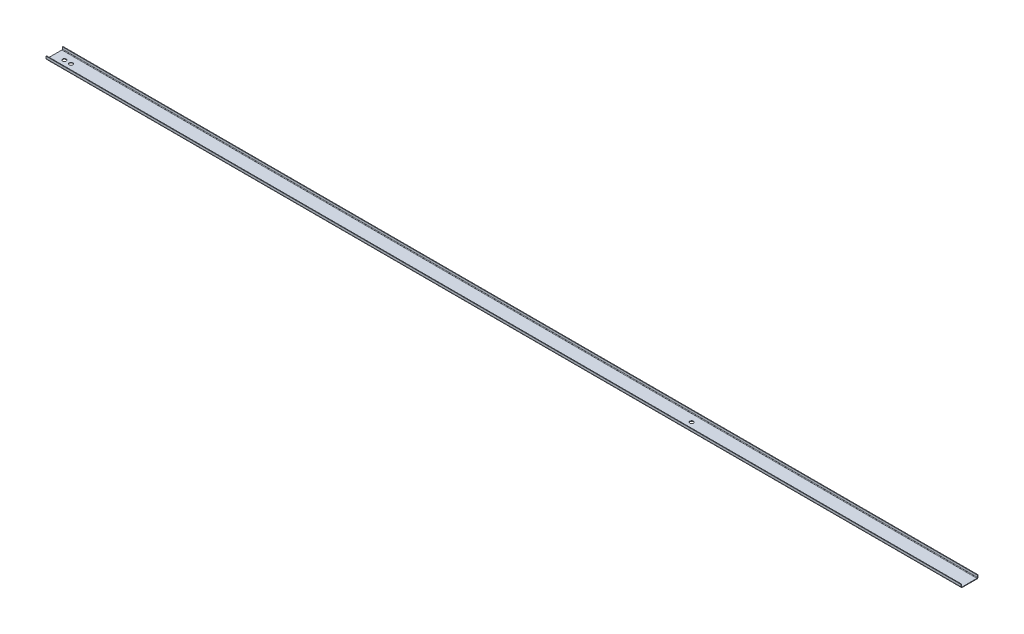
ISO-10303-21;
HEADER;
FILE_DESCRIPTION(('STEP AP214'),'2;1');
FILE_NAME('part.step','',(''),(''),'','','');
FILE_SCHEMA(('AUTOMOTIVE_DESIGN { 1 0 10303 214 1 1 1 1 }'));
ENDSEC;
DATA;
#1=APPLICATION_CONTEXT('core data for automotive mechanical design processes');
#2=APPLICATION_PROTOCOL_DEFINITION('international standard','automotive_design',2000,#1);
#3=PRODUCT_CONTEXT('',#1,'mechanical');
#4=PRODUCT('Part','Part','',(#3));
#5=PRODUCT_RELATED_PRODUCT_CATEGORY('part','',(#4));
#6=PRODUCT_DEFINITION_FORMATION('','',#4);
#7=PRODUCT_DEFINITION_CONTEXT('part definition',#1,'design');
#8=PRODUCT_DEFINITION('design','',#6,#7);
#9=PRODUCT_DEFINITION_SHAPE('','',#8);
#10=(LENGTH_UNIT() NAMED_UNIT(*) SI_UNIT(.MILLI.,.METRE.));
#11=(NAMED_UNIT(*) PLANE_ANGLE_UNIT() SI_UNIT($,.RADIAN.));
#12=(NAMED_UNIT(*) SI_UNIT($,.STERADIAN.) SOLID_ANGLE_UNIT());
#13=UNCERTAINTY_MEASURE_WITH_UNIT(LENGTH_MEASURE(1.E-05),#10,'distance_accuracy_value','');
#14=(GEOMETRIC_REPRESENTATION_CONTEXT(3) GLOBAL_UNCERTAINTY_ASSIGNED_CONTEXT((#13)) GLOBAL_UNIT_ASSIGNED_CONTEXT((#10,
#11,#12)) REPRESENTATION_CONTEXT('',''));
#15=CARTESIAN_POINT('',(0.,0.,0.));
#16=DIRECTION('',(0.,0.,1.));
#17=DIRECTION('',(1.,0.,0.));
#18=AXIS2_PLACEMENT_3D('',#15,#16,#17);
#19=CARTESIAN_POINT('',(870.,2.,16.));
#20=DIRECTION('',(1.,0.,0.));
#21=DIRECTION('',(0.,0.,-1.));
#22=AXIS2_PLACEMENT_3D('',#19,#20,#21);
#23=PLANE('',#22);
#24=DIRECTION('',(0.,0.,-1.));
#25=VECTOR('',#24,1.);
#26=CARTESIAN_POINT('',(870.,2.,16.));
#27=LINE('',#26,#25);
#28=CARTESIAN_POINT('',(870.,2.,16.));
#29=VERTEX_POINT('',#28);
#30=CARTESIAN_POINT('',(870.,2.,15.));
#31=VERTEX_POINT('',#30);
#32=EDGE_CURVE('E11',#29,#31,#27,.T.);
#33=ORIENTED_EDGE('',*,*,#32,.F.);
#34=CARTESIAN_POINT('',(870.,2.,14.));
#35=DIRECTION('',(-1.,0.,0.));
#36=DIRECTION('',(0.,0.,1.));
#37=AXIS2_PLACEMENT_3D('',#34,#35,#36);
#38=CIRCLE('',#37,2.);
#39=CARTESIAN_POINT('',(870.,0.,14.));
#40=VERTEX_POINT('',#39);
#41=EDGE_CURVE('E202',#29,#40,#38,.F.);
#42=ORIENTED_EDGE('',*,*,#41,.T.);
#43=DIRECTION('',(0.,-1.,0.));
#44=VECTOR('',#43,1.);
#45=CARTESIAN_POINT('',(870.,1.,14.));
#46=LINE('',#45,#44);
#47=CARTESIAN_POINT('',(870.,1.,14.));
#48=VERTEX_POINT('',#47);
#49=EDGE_CURVE('E41',#48,#40,#46,.T.);
#50=ORIENTED_EDGE('',*,*,#49,.F.);
#51=CARTESIAN_POINT('',(870.,2.,14.));
#52=DIRECTION('',(1.,0.,0.));
#53=DIRECTION('',(0.,0.,-1.));
#54=AXIS2_PLACEMENT_3D('',#51,#52,#53);
#55=CIRCLE('',#54,1.);
#56=EDGE_CURVE('E190',#31,#48,#55,.T.);
#57=ORIENTED_EDGE('',*,*,#56,.F.);
#58=EDGE_LOOP('',(#33,#42,#50,#57));
#59=FACE_BOUND('',#58,.T.);
#60=ADVANCED_FACE('F34',(#59),#23,.T.);
#61=CARTESIAN_POINT('',(870.,1.,14.));
#62=DIRECTION('',(1.,0.,0.));
#63=DIRECTION('',(0.,0.,-1.));
#64=AXIS2_PLACEMENT_3D('',#61,#62,#63);
#65=PLANE('',#64);
#66=DIRECTION('',(0.,-1.,0.));
#67=VECTOR('',#66,1.);
#68=CARTESIAN_POINT('',(870.,6.,16.));
#69=LINE('',#68,#67);
#70=CARTESIAN_POINT('',(870.,6.,16.));
#71=VERTEX_POINT('',#70);
#72=EDGE_CURVE('E199',#71,#29,#69,.T.);
#73=ORIENTED_EDGE('',*,*,#72,.T.);
#74=ORIENTED_EDGE('',*,*,#32,.T.);
#75=DIRECTION('',(0.,1.,0.));
#76=VECTOR('',#75,1.);
#77=CARTESIAN_POINT('',(870.,6.,15.));
#78=LINE('',#77,#76);
#79=CARTESIAN_POINT('',(870.,6.,15.));
#80=VERTEX_POINT('',#79);
#81=EDGE_CURVE('E193',#80,#31,#78,.F.);
#82=ORIENTED_EDGE('',*,*,#81,.F.);
#83=DIRECTION('',(0.,0.,-1.));
#84=VECTOR('',#83,1.);
#85=CARTESIAN_POINT('',(870.,6.,16.));
#86=LINE('',#85,#84);
#87=EDGE_CURVE('E196',#71,#80,#86,.T.);
#88=ORIENTED_EDGE('',*,*,#87,.F.);
#89=EDGE_LOOP('',(#73,#74,#82,#88));
#90=FACE_BOUND('',#89,.T.);
#91=ADVANCED_FACE('F286',(#90),#65,.T.);
#92=CARTESIAN_POINT('',(-870.,0.,14.));
#93=DIRECTION('',(-1.,0.,0.));
#94=DIRECTION('',(0.,0.,1.));
#95=AXIS2_PLACEMENT_3D('',#92,#93,#94);
#96=PLANE('',#95);
#97=DIRECTION('',(0.,1.,0.));
#98=VECTOR('',#97,1.);
#99=CARTESIAN_POINT('',(-870.,0.,14.));
#100=LINE('',#99,#98);
#101=CARTESIAN_POINT('',(-870.,0.,14.));
#102=VERTEX_POINT('',#101);
#103=CARTESIAN_POINT('',(-870.,1.,14.));
#104=VERTEX_POINT('',#103);
#105=EDGE_CURVE('E243',#102,#104,#100,.T.);
#106=ORIENTED_EDGE('',*,*,#105,.F.);
#107=CARTESIAN_POINT('',(-870.,2.,14.));
#108=DIRECTION('',(-1.,0.,0.));
#109=DIRECTION('',(0.,0.,1.));
#110=AXIS2_PLACEMENT_3D('',#107,#108,#109);
#111=CIRCLE('',#110,2.);
#112=CARTESIAN_POINT('',(-870.,2.,16.));
#113=VERTEX_POINT('',#112);
#114=EDGE_CURVE('E169',#113,#102,#111,.F.);
#115=ORIENTED_EDGE('',*,*,#114,.F.);
#116=DIRECTION('',(0.,0.,1.));
#117=VECTOR('',#116,1.);
#118=CARTESIAN_POINT('',(-870.,2.,15.));
#119=LINE('',#118,#117);
#120=CARTESIAN_POINT('',(-870.,2.,15.));
#121=VERTEX_POINT('',#120);
#122=EDGE_CURVE('E241',#121,#113,#119,.T.);
#123=ORIENTED_EDGE('',*,*,#122,.F.);
#124=CARTESIAN_POINT('',(-870.,2.,14.));
#125=DIRECTION('',(1.,0.,0.));
#126=DIRECTION('',(0.,0.,-1.));
#127=AXIS2_PLACEMENT_3D('',#124,#125,#126);
#128=CIRCLE('',#127,1.);
#129=EDGE_CURVE('E157',#121,#104,#128,.T.);
#130=ORIENTED_EDGE('',*,*,#129,.T.);
#131=EDGE_LOOP('',(#106,#115,#123,#130));
#132=FACE_BOUND('',#131,.T.);
#133=ADVANCED_FACE('F296',(#132),#96,.T.);
#134=CARTESIAN_POINT('',(-870.,2.,15.));
#135=DIRECTION('',(-1.,0.,0.));
#136=DIRECTION('',(0.,0.,1.));
#137=AXIS2_PLACEMENT_3D('',#134,#135,#136);
#138=PLANE('',#137);
#139=DIRECTION('',(0.,0.,-1.));
#140=VECTOR('',#139,1.);
#141=CARTESIAN_POINT('',(-870.,0.,16.));
#142=LINE('',#141,#140);
#143=CARTESIAN_POINT('',(-870.,0.,-14.));
#144=VERTEX_POINT('',#143);
#145=EDGE_CURVE('E172',#102,#144,#142,.T.);
#146=ORIENTED_EDGE('',*,*,#145,.F.);
#147=ORIENTED_EDGE('',*,*,#105,.T.);
#148=DIRECTION('',(0.,0.,-1.));
#149=VECTOR('',#148,1.);
#150=CARTESIAN_POINT('',(-870.,1.,16.));
#151=LINE('',#150,#149);
#152=CARTESIAN_POINT('',(-870.,1.00000000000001,-14.));
#153=VERTEX_POINT('',#152);
#154=EDGE_CURVE('E154',#104,#153,#151,.T.);
#155=ORIENTED_EDGE('',*,*,#154,.T.);
#156=DIRECTION('',(0.,-1.,0.));
#157=VECTOR('',#156,1.);
#158=CARTESIAN_POINT('',(-870.,1.00000000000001,-14.));
#159=LINE('',#158,#157);
#160=EDGE_CURVE('E132',#153,#144,#159,.T.);
#161=ORIENTED_EDGE('',*,*,#160,.T.);
#162=EDGE_LOOP('',(#146,#147,#155,#161));
#163=FACE_BOUND('',#162,.T.);
#164=ADVANCED_FACE('F298',(#163),#138,.T.);
#165=CARTESIAN_POINT('',(870.,0.,-14.));
#166=DIRECTION('',(1.,0.,0.));
#167=DIRECTION('',(0.,0.,-1.));
#168=AXIS2_PLACEMENT_3D('',#165,#166,#167);
#169=PLANE('',#168);
#170=DIRECTION('',(0.,1.,0.));
#171=VECTOR('',#170,1.);
#172=CARTESIAN_POINT('',(870.,0.,-14.));
#173=LINE('',#172,#171);
#174=CARTESIAN_POINT('',(870.,0.,-14.));
#175=VERTEX_POINT('',#174);
#176=CARTESIAN_POINT('',(870.,1.00000000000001,-14.));
#177=VERTEX_POINT('',#176);
#178=EDGE_CURVE('E55',#175,#177,#173,.T.);
#179=ORIENTED_EDGE('',*,*,#178,.F.);
#180=CARTESIAN_POINT('',(870.,2.00000000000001,-14.));
#181=DIRECTION('',(-1.,0.,0.));
#182=DIRECTION('',(0.,0.,1.));
#183=AXIS2_PLACEMENT_3D('',#180,#181,#182);
#184=CIRCLE('',#183,2.);
#185=CARTESIAN_POINT('',(870.,2.00000000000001,-16.));
#186=VERTEX_POINT('',#185);
#187=EDGE_CURVE('E207',#175,#186,#184,.F.);
#188=ORIENTED_EDGE('',*,*,#187,.T.);
#189=DIRECTION('',(0.,0.,-1.));
#190=VECTOR('',#189,1.);
#191=CARTESIAN_POINT('',(870.,2.00000000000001,-15.));
#192=LINE('',#191,#190);
#193=CARTESIAN_POINT('',(870.,2.00000000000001,-15.));
#194=VERTEX_POINT('',#193);
#195=EDGE_CURVE('E48',#194,#186,#192,.T.);
#196=ORIENTED_EDGE('',*,*,#195,.F.);
#197=CARTESIAN_POINT('',(870.,2.00000000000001,-14.));
#198=DIRECTION('',(1.,0.,0.));
#199=DIRECTION('',(0.,0.,-1.));
#200=AXIS2_PLACEMENT_3D('',#197,#198,#199);
#201=CIRCLE('',#200,1.);
#202=EDGE_CURVE('E184',#177,#194,#201,.T.);
#203=ORIENTED_EDGE('',*,*,#202,.F.);
#204=EDGE_LOOP('',(#179,#188,#196,#203));
#205=FACE_BOUND('',#204,.T.);
#206=ADVANCED_FACE('F264',(#205),#169,.T.);
#207=CARTESIAN_POINT('',(870.,2.00000000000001,-15.));
#208=DIRECTION('',(1.,0.,0.));
#209=DIRECTION('',(0.,0.,-1.));
#210=AXIS2_PLACEMENT_3D('',#207,#208,#209);
#211=PLANE('',#210);
#212=DIRECTION('',(0.,0.,-1.));
#213=VECTOR('',#212,1.);
#214=CARTESIAN_POINT('',(870.,0.,16.));
#215=LINE('',#214,#213);
#216=EDGE_CURVE('E205',#40,#175,#215,.T.);
#217=ORIENTED_EDGE('',*,*,#216,.T.);
#218=ORIENTED_EDGE('',*,*,#178,.T.);
#219=DIRECTION('',(0.,0.,-1.));
#220=VECTOR('',#219,1.);
#221=CARTESIAN_POINT('',(870.,1.,16.));
#222=LINE('',#221,#220);
#223=EDGE_CURVE('E187',#48,#177,#222,.T.);
#224=ORIENTED_EDGE('',*,*,#223,.F.);
#225=ORIENTED_EDGE('',*,*,#49,.T.);
#226=EDGE_LOOP('',(#217,#218,#224,#225));
#227=FACE_BOUND('',#226,.T.);
#228=ADVANCED_FACE('F246',(#227),#211,.T.);
#229=CARTESIAN_POINT('',(-870.,2.00000000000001,-16.));
#230=DIRECTION('',(-1.,0.,0.));
#231=DIRECTION('',(0.,0.,1.));
#232=AXIS2_PLACEMENT_3D('',#229,#230,#231);
#233=PLANE('',#232);
#234=DIRECTION('',(0.,0.,1.));
#235=VECTOR('',#234,1.);
#236=CARTESIAN_POINT('',(-870.,2.00000000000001,-16.));
#237=LINE('',#236,#235);
#238=CARTESIAN_POINT('',(-870.,2.00000000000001,-16.));
#239=VERTEX_POINT('',#238);
#240=CARTESIAN_POINT('',(-870.,2.00000000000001,-15.));
#241=VERTEX_POINT('',#240);
#242=EDGE_CURVE('E237',#239,#241,#237,.T.);
#243=ORIENTED_EDGE('',*,*,#242,.F.);
#244=CARTESIAN_POINT('',(-870.,2.00000000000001,-14.));
#245=DIRECTION('',(-1.,0.,0.));
#246=DIRECTION('',(0.,0.,1.));
#247=AXIS2_PLACEMENT_3D('',#244,#245,#246);
#248=CIRCLE('',#247,2.);
#249=EDGE_CURVE('E175',#144,#239,#248,.F.);
#250=ORIENTED_EDGE('',*,*,#249,.F.);
#251=ORIENTED_EDGE('',*,*,#160,.F.);
#252=CARTESIAN_POINT('',(-870.,2.00000000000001,-14.));
#253=DIRECTION('',(1.,0.,0.));
#254=DIRECTION('',(0.,0.,-1.));
#255=AXIS2_PLACEMENT_3D('',#252,#253,#254);
#256=CIRCLE('',#255,1.);
#257=EDGE_CURVE('E148',#153,#241,#256,.T.);
#258=ORIENTED_EDGE('',*,*,#257,.T.);
#259=EDGE_LOOP('',(#243,#250,#251,#258));
#260=FACE_BOUND('',#259,.T.);
#261=ADVANCED_FACE('F300',(#260),#233,.T.);
#262=CARTESIAN_POINT('',(-870.,1.00000000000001,-14.));
#263=DIRECTION('',(-1.,0.,0.));
#264=DIRECTION('',(0.,0.,1.));
#265=AXIS2_PLACEMENT_3D('',#262,#263,#264);
#266=PLANE('',#265);
#267=DIRECTION('',(0.,1.,0.));
#268=VECTOR('',#267,1.);
#269=CARTESIAN_POINT('',(-870.,0.,-16.));
#270=LINE('',#269,#268);
#271=CARTESIAN_POINT('',(-870.,6.00000000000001,-16.));
#272=VERTEX_POINT('',#271);
#273=EDGE_CURVE('E137',#239,#272,#270,.T.);
#274=ORIENTED_EDGE('',*,*,#273,.F.);
#275=ORIENTED_EDGE('',*,*,#242,.T.);
#276=DIRECTION('',(0.,1.,0.));
#277=VECTOR('',#276,1.);
#278=CARTESIAN_POINT('',(-870.,0.,-15.));
#279=LINE('',#278,#277);
#280=CARTESIAN_POINT('',(-870.,6.00000000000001,-15.));
#281=VERTEX_POINT('',#280);
#282=EDGE_CURVE('E146',#241,#281,#279,.T.);
#283=ORIENTED_EDGE('',*,*,#282,.T.);
#284=DIRECTION('',(0.,0.,-1.));
#285=VECTOR('',#284,1.);
#286=CARTESIAN_POINT('',(-870.,6.00000000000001,-15.));
#287=LINE('',#286,#285);
#288=EDGE_CURVE('E126',#281,#272,#287,.T.);
#289=ORIENTED_EDGE('',*,*,#288,.T.);
#290=EDGE_LOOP('',(#274,#275,#283,#289));
#291=FACE_BOUND('',#290,.T.);
#292=ADVANCED_FACE('F144',(#291),#266,.T.);
#293=CARTESIAN_POINT('',(870.,0.,-16.));
#294=DIRECTION('',(0.,0.,1.));
#295=DIRECTION('',(1.,0.,0.));
#296=AXIS2_PLACEMENT_3D('',#293,#294,#295);
#297=PLANE('',#296);
#298=ORIENTED_EDGE('',*,*,#273,.T.);
#299=DIRECTION('',(-1.,0.,0.));
#300=VECTOR('',#299,1.);
#301=CARTESIAN_POINT('',(870.,6.00000000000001,-16.));
#302=LINE('',#301,#300);
#303=CARTESIAN_POINT('',(870.,6.00000000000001,-16.));
#304=VERTEX_POINT('',#303);
#305=EDGE_CURVE('E122',#304,#272,#302,.T.);
#306=ORIENTED_EDGE('',*,*,#305,.F.);
#307=DIRECTION('',(0.,1.,0.));
#308=VECTOR('',#307,1.);
#309=CARTESIAN_POINT('',(870.,0.,-16.));
#310=LINE('',#309,#308);
#311=EDGE_CURVE('E178',#186,#304,#310,.T.);
#312=ORIENTED_EDGE('',*,*,#311,.F.);
#313=DIRECTION('',(-1.,0.,0.));
#314=VECTOR('',#313,1.);
#315=CARTESIAN_POINT('',(870.,2.00000000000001,-16.));
#316=LINE('',#315,#314);
#317=EDGE_CURVE('E140',#186,#239,#316,.T.);
#318=ORIENTED_EDGE('',*,*,#317,.T.);
#319=EDGE_LOOP('',(#298,#306,#312,#318));
#320=FACE_BOUND('',#319,.T.);
#321=ADVANCED_FACE('F138',(#320),#297,.F.);
#322=CARTESIAN_POINT('',(870.,6.00000000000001,-15.));
#323=DIRECTION('',(0.,1.,0.));
#324=DIRECTION('',(0.,0.,1.));
#325=AXIS2_PLACEMENT_3D('',#322,#323,#324);
#326=PLANE('',#325);
#327=ORIENTED_EDGE('',*,*,#288,.F.);
#328=DIRECTION('',(-1.,0.,0.));
#329=VECTOR('',#328,1.);
#330=CARTESIAN_POINT('',(870.,6.00000000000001,-15.));
#331=LINE('',#330,#329);
#332=CARTESIAN_POINT('',(870.,6.00000000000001,-15.));
#333=VERTEX_POINT('',#332);
#334=EDGE_CURVE('E133',#333,#281,#331,.T.);
#335=ORIENTED_EDGE('',*,*,#334,.F.);
#336=DIRECTION('',(0.,0.,-1.));
#337=VECTOR('',#336,1.);
#338=CARTESIAN_POINT('',(870.,6.00000000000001,-15.));
#339=LINE('',#338,#337);
#340=EDGE_CURVE('E129',#333,#304,#339,.T.);
#341=ORIENTED_EDGE('',*,*,#340,.T.);
#342=ORIENTED_EDGE('',*,*,#305,.T.);
#343=EDGE_LOOP('',(#327,#335,#341,#342));
#344=FACE_BOUND('',#343,.T.);
#345=ADVANCED_FACE('F124',(#344),#326,.T.);
#346=CARTESIAN_POINT('',(870.,0.,-15.));
#347=DIRECTION('',(0.,0.,1.));
#348=DIRECTION('',(1.,0.,0.));
#349=AXIS2_PLACEMENT_3D('',#346,#347,#348);
#350=PLANE('',#349);
#351=ORIENTED_EDGE('',*,*,#282,.F.);
#352=DIRECTION('',(-1.,0.,0.));
#353=VECTOR('',#352,1.);
#354=CARTESIAN_POINT('',(870.,2.00000000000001,-15.));
#355=LINE('',#354,#353);
#356=EDGE_CURVE('E232',#194,#241,#355,.T.);
#357=ORIENTED_EDGE('',*,*,#356,.F.);
#358=DIRECTION('',(0.,1.,0.));
#359=VECTOR('',#358,1.);
#360=CARTESIAN_POINT('',(870.,0.,-15.));
#361=LINE('',#360,#359);
#362=EDGE_CURVE('E181',#194,#333,#361,.T.);
#363=ORIENTED_EDGE('',*,*,#362,.T.);
#364=ORIENTED_EDGE('',*,*,#334,.T.);
#365=EDGE_LOOP('',(#351,#357,#363,#364));
#366=FACE_BOUND('',#365,.T.);
#367=ADVANCED_FACE('F267',(#366),#350,.T.);
#368=CARTESIAN_POINT('',(870.,2.00000000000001,-14.));
#369=DIRECTION('',(-1.,0.,0.));
#370=DIRECTION('',(0.,0.,1.));
#371=AXIS2_PLACEMENT_3D('',#368,#369,#370);
#372=CYLINDRICAL_SURFACE('',#371,1.);
#373=ORIENTED_EDGE('',*,*,#257,.F.);
#374=DIRECTION('',(-1.,0.,0.));
#375=VECTOR('',#374,1.);
#376=CARTESIAN_POINT('',(870.,1.00000000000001,-14.));
#377=LINE('',#376,#375);
#378=EDGE_CURVE('E229',#177,#153,#377,.T.);
#379=ORIENTED_EDGE('',*,*,#378,.F.);
#380=ORIENTED_EDGE('',*,*,#202,.T.);
#381=ORIENTED_EDGE('',*,*,#356,.T.);
#382=EDGE_LOOP('',(#373,#379,#380,#381));
#383=FACE_BOUND('',#382,.T.);
#384=ADVANCED_FACE('F272',(#383),#372,.F.);
#385=CARTESIAN_POINT('',(870.,1.,16.));
#386=DIRECTION('',(0.,1.,0.));
#387=DIRECTION('',(0.,0.,1.));
#388=AXIS2_PLACEMENT_3D('',#385,#386,#387);
#389=PLANE('',#388);
#390=CARTESIAN_POINT('',(-851.,1.,0.));
#391=DIRECTION('',(0.,1.,0.));
#392=DIRECTION('',(0.,0.,1.));
#393=AXIS2_PLACEMENT_3D('',#390,#391,#392);
#394=CIRCLE('',#393,3.39999999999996);
#395=CARTESIAN_POINT('',(-851.,1.,3.39999999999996));
#396=VERTEX_POINT('',#395);
#397=EDGE_CURVE('E512',#396,#396,#394,.T.);
#398=ORIENTED_EDGE('',*,*,#397,.F.);
#399=EDGE_LOOP('',(#398));
#400=FACE_BOUND('',#399,.T.);
#401=CARTESIAN_POINT('',(341.5,1.,0.));
#402=DIRECTION('',(0.,1.,0.));
#403=DIRECTION('',(0.,0.,1.));
#404=AXIS2_PLACEMENT_3D('',#401,#402,#403);
#405=CIRCLE('',#404,3.40000000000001);
#406=CARTESIAN_POINT('',(341.5,1.,3.40000000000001));
#407=VERTEX_POINT('',#406);
#408=EDGE_CURVE('E516',#407,#407,#405,.T.);
#409=ORIENTED_EDGE('',*,*,#408,.F.);
#410=EDGE_LOOP('',(#409));
#411=FACE_BOUND('',#410,.T.);
#412=CARTESIAN_POINT('',(-838.5,1.,0.));
#413=DIRECTION('',(0.,1.,0.));
#414=DIRECTION('',(0.,0.,1.));
#415=AXIS2_PLACEMENT_3D('',#412,#413,#414);
#416=CIRCLE('',#415,3.39999999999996);
#417=CARTESIAN_POINT('',(-838.5,1.,3.39999999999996));
#418=VERTEX_POINT('',#417);
#419=EDGE_CURVE('E142',#418,#418,#416,.T.);
#420=ORIENTED_EDGE('',*,*,#419,.F.);
#421=EDGE_LOOP('',(#420));
#422=FACE_BOUND('',#421,.T.);
#423=ORIENTED_EDGE('',*,*,#154,.F.);
#424=DIRECTION('',(-1.,0.,0.));
#425=VECTOR('',#424,1.);
#426=CARTESIAN_POINT('',(870.,1.,14.));
#427=LINE('',#426,#425);
#428=EDGE_CURVE('E226',#48,#104,#427,.T.);
#429=ORIENTED_EDGE('',*,*,#428,.F.);
#430=ORIENTED_EDGE('',*,*,#223,.T.);
#431=ORIENTED_EDGE('',*,*,#378,.T.);
#432=EDGE_LOOP('',(#423,#429,#430,#431));
#433=FACE_BOUND('',#432,.T.);
#434=ADVANCED_FACE('F275',(#400,#411,#422,#433),#389,.T.);
#435=CARTESIAN_POINT('',(870.,2.,14.));
#436=DIRECTION('',(-1.,0.,0.));
#437=DIRECTION('',(0.,0.,1.));
#438=AXIS2_PLACEMENT_3D('',#435,#436,#437);
#439=CYLINDRICAL_SURFACE('',#438,1.);
#440=ORIENTED_EDGE('',*,*,#129,.F.);
#441=DIRECTION('',(-1.,0.,0.));
#442=VECTOR('',#441,1.);
#443=CARTESIAN_POINT('',(870.,2.,15.));
#444=LINE('',#443,#442);
#445=EDGE_CURVE('E223',#31,#121,#444,.T.);
#446=ORIENTED_EDGE('',*,*,#445,.F.);
#447=ORIENTED_EDGE('',*,*,#56,.T.);
#448=ORIENTED_EDGE('',*,*,#428,.T.);
#449=EDGE_LOOP('',(#440,#446,#447,#448));
#450=FACE_BOUND('',#449,.T.);
#451=ADVANCED_FACE('F278',(#450),#439,.F.);
#452=CARTESIAN_POINT('',(870.,6.,15.));
#453=DIRECTION('',(0.,0.,-1.));
#454=DIRECTION('',(-1.,0.,0.));
#455=AXIS2_PLACEMENT_3D('',#452,#453,#454);
#456=PLANE('',#455);
#457=DIRECTION('',(0.,1.,0.));
#458=VECTOR('',#457,1.);
#459=CARTESIAN_POINT('',(-870.,6.,15.));
#460=LINE('',#459,#458);
#461=CARTESIAN_POINT('',(-870.,6.,15.));
#462=VERTEX_POINT('',#461);
#463=EDGE_CURVE('E160',#462,#121,#460,.F.);
#464=ORIENTED_EDGE('',*,*,#463,.F.);
#465=DIRECTION('',(-1.,0.,0.));
#466=VECTOR('',#465,1.);
#467=CARTESIAN_POINT('',(870.,6.,15.));
#468=LINE('',#467,#466);
#469=EDGE_CURVE('E221',#80,#462,#468,.T.);
#470=ORIENTED_EDGE('',*,*,#469,.F.);
#471=ORIENTED_EDGE('',*,*,#81,.T.);
#472=ORIENTED_EDGE('',*,*,#445,.T.);
#473=EDGE_LOOP('',(#464,#470,#471,#472));
#474=FACE_BOUND('',#473,.T.);
#475=ADVANCED_FACE('F283',(#474),#456,.T.);
#476=CARTESIAN_POINT('',(870.,6.,16.));
#477=DIRECTION('',(0.,1.,0.));
#478=DIRECTION('',(0.,0.,1.));
#479=AXIS2_PLACEMENT_3D('',#476,#477,#478);
#480=PLANE('',#479);
#481=DIRECTION('',(0.,0.,-1.));
#482=VECTOR('',#481,1.);
#483=CARTESIAN_POINT('',(-870.,6.,16.));
#484=LINE('',#483,#482);
#485=CARTESIAN_POINT('',(-870.,6.,16.));
#486=VERTEX_POINT('',#485);
#487=EDGE_CURVE('E163',#486,#462,#484,.T.);
#488=ORIENTED_EDGE('',*,*,#487,.F.);
#489=DIRECTION('',(-1.,0.,0.));
#490=VECTOR('',#489,1.);
#491=CARTESIAN_POINT('',(870.,6.,16.));
#492=LINE('',#491,#490);
#493=EDGE_CURVE('E219',#71,#486,#492,.T.);
#494=ORIENTED_EDGE('',*,*,#493,.F.);
#495=ORIENTED_EDGE('',*,*,#87,.T.);
#496=ORIENTED_EDGE('',*,*,#469,.T.);
#497=EDGE_LOOP('',(#488,#494,#495,#496));
#498=FACE_BOUND('',#497,.T.);
#499=ADVANCED_FACE('F289',(#498),#480,.T.);
#500=CARTESIAN_POINT('',(870.,6.,16.));
#501=DIRECTION('',(0.,0.,-1.));
#502=DIRECTION('',(-1.,0.,0.));
#503=AXIS2_PLACEMENT_3D('',#500,#501,#502);
#504=PLANE('',#503);
#505=DIRECTION('',(0.,-1.,0.));
#506=VECTOR('',#505,1.);
#507=CARTESIAN_POINT('',(-870.,6.,16.));
#508=LINE('',#507,#506);
#509=EDGE_CURVE('E166',#486,#113,#508,.T.);
#510=ORIENTED_EDGE('',*,*,#509,.T.);
#511=DIRECTION('',(-1.,0.,0.));
#512=VECTOR('',#511,1.);
#513=CARTESIAN_POINT('',(870.,2.,16.));
#514=LINE('',#513,#512);
#515=EDGE_CURVE('E216',#29,#113,#514,.T.);
#516=ORIENTED_EDGE('',*,*,#515,.F.);
#517=ORIENTED_EDGE('',*,*,#72,.F.);
#518=ORIENTED_EDGE('',*,*,#493,.T.);
#519=EDGE_LOOP('',(#510,#516,#517,#518));
#520=FACE_BOUND('',#519,.T.);
#521=ADVANCED_FACE('F294',(#520),#504,.F.);
#522=CARTESIAN_POINT('',(870.,2.,14.));
#523=DIRECTION('',(-1.,0.,0.));
#524=DIRECTION('',(0.,0.,1.));
#525=AXIS2_PLACEMENT_3D('',#522,#523,#524);
#526=CYLINDRICAL_SURFACE('',#525,2.);
#527=ORIENTED_EDGE('',*,*,#114,.T.);
#528=DIRECTION('',(-1.,0.,0.));
#529=VECTOR('',#528,1.);
#530=CARTESIAN_POINT('',(870.,0.,14.));
#531=LINE('',#530,#529);
#532=EDGE_CURVE('E213',#40,#102,#531,.T.);
#533=ORIENTED_EDGE('',*,*,#532,.F.);
#534=ORIENTED_EDGE('',*,*,#41,.F.);
#535=ORIENTED_EDGE('',*,*,#515,.T.);
#536=EDGE_LOOP('',(#527,#533,#534,#535));
#537=FACE_BOUND('',#536,.T.);
#538=ADVANCED_FACE('F255',(#537),#526,.T.);
#539=CARTESIAN_POINT('',(870.,0.,16.));
#540=DIRECTION('',(0.,1.,0.));
#541=DIRECTION('',(0.,0.,1.));
#542=AXIS2_PLACEMENT_3D('',#539,#540,#541);
#543=PLANE('',#542);
#544=CARTESIAN_POINT('',(-851.,0.,0.));
#545=DIRECTION('',(0.,1.,0.));
#546=DIRECTION('',(0.,0.,1.));
#547=AXIS2_PLACEMENT_3D('',#544,#545,#546);
#548=CIRCLE('',#547,3.39999999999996);
#549=CARTESIAN_POINT('',(-851.,0.,3.39999999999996));
#550=VERTEX_POINT('',#549);
#551=EDGE_CURVE('E509',#550,#550,#548,.T.);
#552=ORIENTED_EDGE('',*,*,#551,.T.);
#553=EDGE_LOOP('',(#552));
#554=FACE_BOUND('',#553,.T.);
#555=CARTESIAN_POINT('',(341.5,0.,0.));
#556=DIRECTION('',(0.,1.,0.));
#557=DIRECTION('',(0.,0.,1.));
#558=AXIS2_PLACEMENT_3D('',#555,#556,#557);
#559=CIRCLE('',#558,3.40000000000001);
#560=CARTESIAN_POINT('',(341.5,0.,3.40000000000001));
#561=VERTEX_POINT('',#560);
#562=EDGE_CURVE('E513',#561,#561,#559,.T.);
#563=ORIENTED_EDGE('',*,*,#562,.T.);
#564=EDGE_LOOP('',(#563));
#565=FACE_BOUND('',#564,.T.);
#566=CARTESIAN_POINT('',(-838.5,0.,0.));
#567=DIRECTION('',(0.,1.,0.));
#568=DIRECTION('',(0.,0.,1.));
#569=AXIS2_PLACEMENT_3D('',#566,#567,#568);
#570=CIRCLE('',#569,3.39999999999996);
#571=CARTESIAN_POINT('',(-838.5,0.,3.39999999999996));
#572=VERTEX_POINT('',#571);
#573=EDGE_CURVE('E522',#572,#572,#570,.T.);
#574=ORIENTED_EDGE('',*,*,#573,.T.);
#575=EDGE_LOOP('',(#574));
#576=FACE_BOUND('',#575,.T.);
#577=ORIENTED_EDGE('',*,*,#145,.T.);
#578=DIRECTION('',(-1.,0.,0.));
#579=VECTOR('',#578,1.);
#580=CARTESIAN_POINT('',(870.,0.,-14.));
#581=LINE('',#580,#579);
#582=EDGE_CURVE('E210',#175,#144,#581,.T.);
#583=ORIENTED_EDGE('',*,*,#582,.F.);
#584=ORIENTED_EDGE('',*,*,#216,.F.);
#585=ORIENTED_EDGE('',*,*,#532,.T.);
#586=EDGE_LOOP('',(#577,#583,#584,#585));
#587=FACE_BOUND('',#586,.T.);
#588=ADVANCED_FACE('F259',(#554,#565,#576,#587),#543,.F.);
#589=CARTESIAN_POINT('',(870.,2.00000000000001,-14.));
#590=DIRECTION('',(-1.,0.,0.));
#591=DIRECTION('',(0.,0.,1.));
#592=AXIS2_PLACEMENT_3D('',#589,#590,#591);
#593=CYLINDRICAL_SURFACE('',#592,2.);
#594=ORIENTED_EDGE('',*,*,#249,.T.);
#595=ORIENTED_EDGE('',*,*,#317,.F.);
#596=ORIENTED_EDGE('',*,*,#187,.F.);
#597=ORIENTED_EDGE('',*,*,#582,.T.);
#598=EDGE_LOOP('',(#594,#595,#596,#597));
#599=FACE_BOUND('',#598,.T.);
#600=ADVANCED_FACE('F263',(#599),#593,.T.);
#601=CARTESIAN_POINT('',(870.,2.00000000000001,-14.));
#602=DIRECTION('',(1.,0.,0.));
#603=DIRECTION('',(0.,0.,-1.));
#604=AXIS2_PLACEMENT_3D('',#601,#602,#603);
#605=PLANE('',#604);
#606=ORIENTED_EDGE('',*,*,#311,.T.);
#607=ORIENTED_EDGE('',*,*,#340,.F.);
#608=ORIENTED_EDGE('',*,*,#362,.F.);
#609=ORIENTED_EDGE('',*,*,#195,.T.);
#610=EDGE_LOOP('',(#606,#607,#608,#609));
#611=FACE_BOUND('',#610,.T.);
#612=ADVANCED_FACE('F270',(#611),#605,.T.);
#613=CARTESIAN_POINT('',(-870.,2.00000000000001,-14.));
#614=DIRECTION('',(1.,0.,0.));
#615=DIRECTION('',(0.,0.,-1.));
#616=AXIS2_PLACEMENT_3D('',#613,#614,#615);
#617=PLANE('',#616);
#618=ORIENTED_EDGE('',*,*,#463,.T.);
#619=ORIENTED_EDGE('',*,*,#122,.T.);
#620=ORIENTED_EDGE('',*,*,#509,.F.);
#621=ORIENTED_EDGE('',*,*,#487,.T.);
#622=EDGE_LOOP('',(#618,#619,#620,#621));
#623=FACE_BOUND('',#622,.T.);
#624=ADVANCED_FACE('F445',(#623),#617,.F.);
#625=CARTESIAN_POINT('',(-838.5,1.,0.));
#626=DIRECTION('',(0.,1.,0.));
#627=DIRECTION('',(0.,0.,1.));
#628=AXIS2_PLACEMENT_3D('',#625,#626,#627);
#629=CYLINDRICAL_SURFACE('',#628,3.39999999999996);
#630=ORIENTED_EDGE('',*,*,#573,.F.);
#631=EDGE_LOOP('',(#630));
#632=FACE_BOUND('',#631,.T.);
#633=ORIENTED_EDGE('',*,*,#419,.T.);
#634=EDGE_LOOP('',(#633));
#635=FACE_BOUND('',#634,.T.);
#636=ADVANCED_FACE('F455',(#632,#635),#629,.F.);
#637=CARTESIAN_POINT('',(341.5,1.,0.));
#638=DIRECTION('',(0.,1.,0.));
#639=DIRECTION('',(0.,0.,1.));
#640=AXIS2_PLACEMENT_3D('',#637,#638,#639);
#641=CYLINDRICAL_SURFACE('',#640,3.40000000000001);
#642=ORIENTED_EDGE('',*,*,#562,.F.);
#643=EDGE_LOOP('',(#642));
#644=FACE_BOUND('',#643,.T.);
#645=ORIENTED_EDGE('',*,*,#408,.T.);
#646=EDGE_LOOP('',(#645));
#647=FACE_BOUND('',#646,.T.);
#648=ADVANCED_FACE('F482',(#644,#647),#641,.F.);
#649=CARTESIAN_POINT('',(-851.,1.,0.));
#650=DIRECTION('',(0.,1.,0.));
#651=DIRECTION('',(0.,0.,1.));
#652=AXIS2_PLACEMENT_3D('',#649,#650,#651);
#653=CYLINDRICAL_SURFACE('',#652,3.39999999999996);
#654=ORIENTED_EDGE('',*,*,#551,.F.);
#655=EDGE_LOOP('',(#654));
#656=FACE_BOUND('',#655,.T.);
#657=ORIENTED_EDGE('',*,*,#397,.T.);
#658=EDGE_LOOP('',(#657));
#659=FACE_BOUND('',#658,.T.);
#660=ADVANCED_FACE('F492',(#656,#659),#653,.F.);
#661=CLOSED_SHELL('',(#60,#91,#133,#164,#206,#228,#261,#292,#321,#345,#367,#384,#434,#451,#475,
#499,#521,#538,#588,#600,#612,#624,#636,#648,#660));
#662=MANIFOLD_SOLID_BREP('B2',#661);
#663=ADVANCED_BREP_SHAPE_REPRESENTATION('',(#18,#662),#14);
#664=SHAPE_DEFINITION_REPRESENTATION(#9,#663);
ENDSEC;
END-ISO-10303-21;
